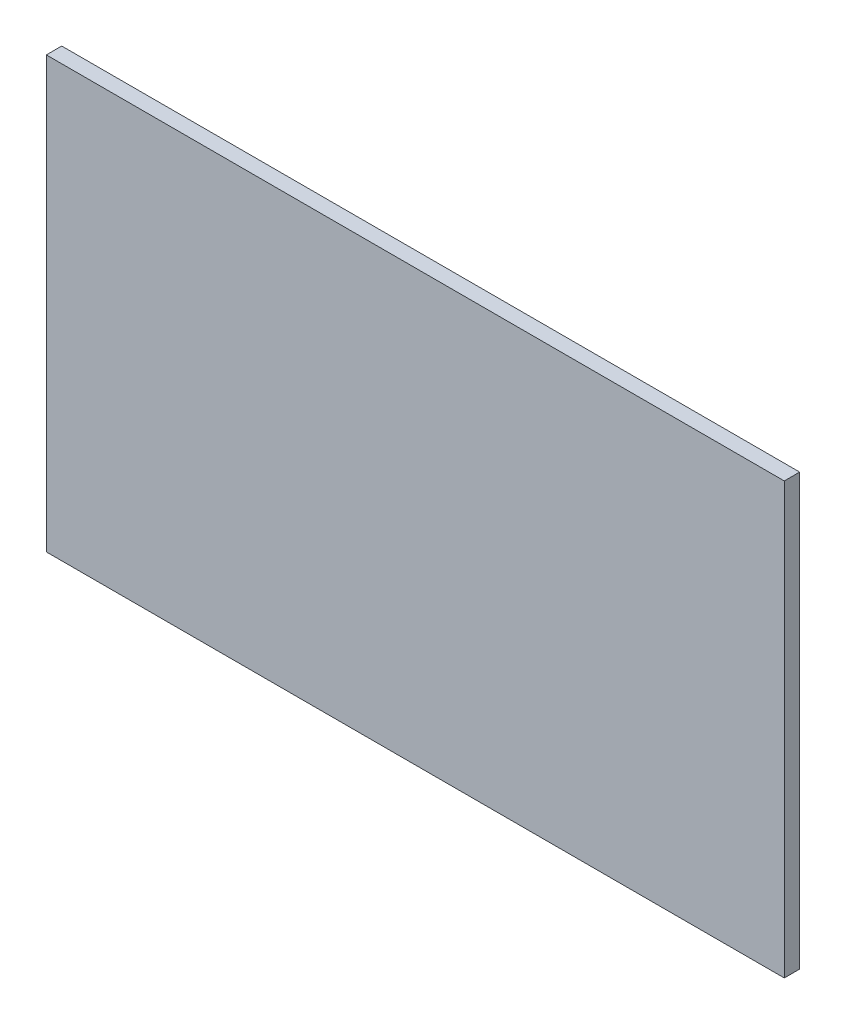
from build123d import *

# Parameters (mm, degrees)
SKETCH2_W           = 609.6
SKETCH2_H           = 355.6
BOSS_EXTRUDE1_DEPTH = 12.7


with BuildPart() as part:
    # Sketch2 → Boss-Extrude1 (new body)
    with BuildSketch(Plane.XY):
        with Locations((304.8, 177.8)):
            Rectangle(SKETCH2_W, SKETCH2_H)
    extrude(amount=BOSS_EXTRUDE1_DEPTH)


solid = part.part
